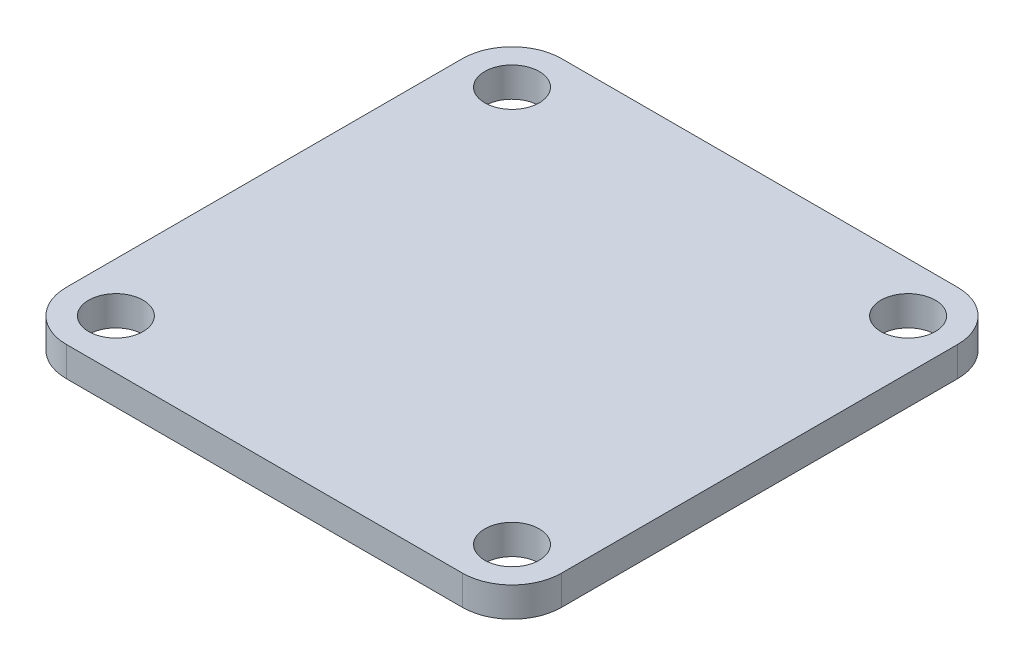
from build123d import *

# Parameters (mm, degrees)
SKETCH1_R           = 2.75
BOSS_EXTRUDE1_DEPTH = 3


with BuildPart() as part:
    # Sketch1 → Boss-Extrude1 (new body)
    with BuildSketch(Plane(origin=(0, 0, 0), x_dir=(1, 0, 0), z_dir=(0, 1, 0))):
        with BuildLine():
            Line((-20, 25), (20, 25))
            ThreePointArc((20, 25), (23.535533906, 23.535533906), (25, 20))
            Line((25, 20), (25, -20))
            ThreePointArc((25, -20), (23.535533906, -23.535533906), (20, -25))
            Line((20, -25), (-20, -25))
            ThreePointArc((-20, -25), (-23.535533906, -23.535533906), (-25, -20))
            Line((-25, -20), (-25, 20))
            ThreePointArc((-25, 20), (-23.535533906, 23.535533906), (-20, 25))
        make_face()
        with Locations(Location((-20, 20, 0), (0, 0, 270))):
            Circle(SKETCH1_R, mode=Mode.SUBTRACT)
        with Locations(Location((20, 20, 0), (0, 0, 270))):
            Circle(SKETCH1_R, mode=Mode.SUBTRACT)
        with Locations(Location((-20, -20, 0), (0, 0, 270))):
            Circle(SKETCH1_R, mode=Mode.SUBTRACT)
        with Locations(Location((20, -20, 0), (0, 0, 270))):
            Circle(SKETCH1_R, mode=Mode.SUBTRACT)
    extrude(amount=BOSS_EXTRUDE1_DEPTH)


solid = part.part
